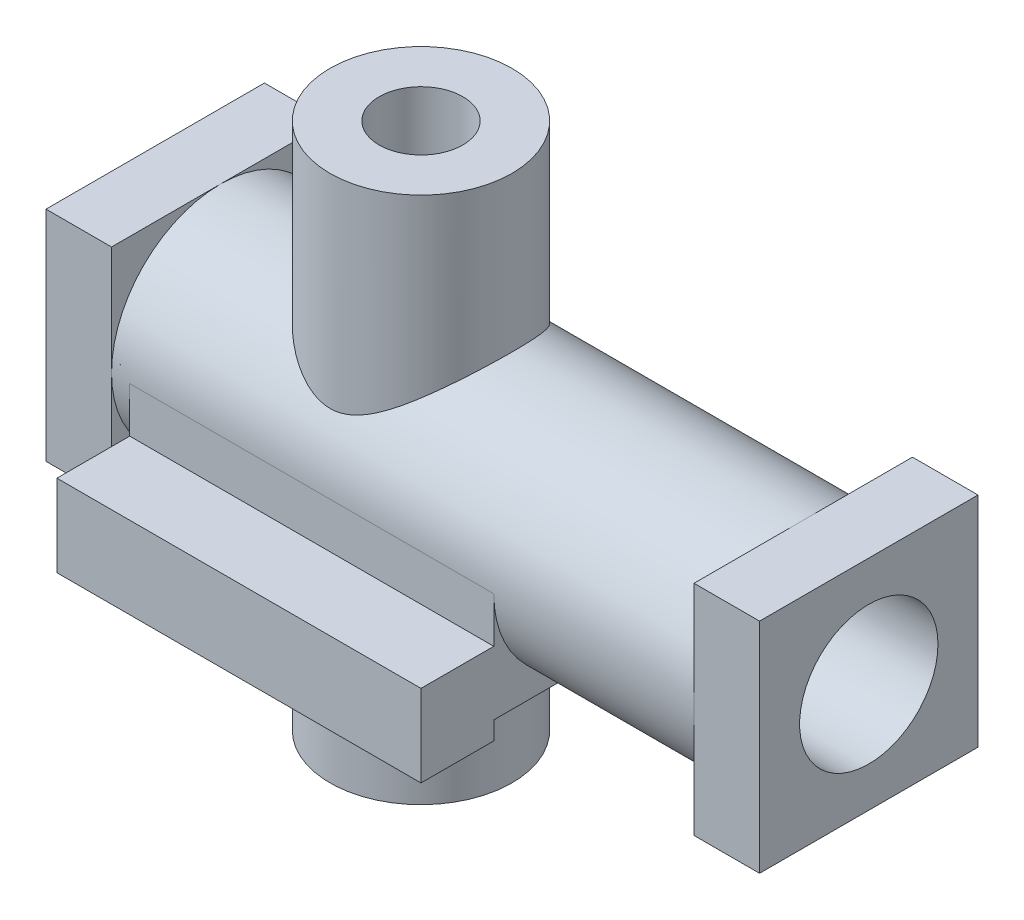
from build123d import *

# Parameters (mm, degrees)
HORIZBODY_DEPTH               = 304.8
HORIZBODY_DEPTH_BACK          = 177.8
SKETCH1_R                     = 76.2
SKETCH2_R                     = 63.5
VERTBODY_DEPTH                = 177.8
SKETCH3_W                     = 152.4
SKETCH3_H                     = 152.4
RIGHTFLANGE_DEPTH             = 38.1
SKETCH4_W                     = 152.4
SKETCH4_H                     = 152.4
LEFTFLANGE_DEPTH              = 38.1
BASEFLANGE_DEPTH              = 127
HORIZBORE_DEPTH               = 376.026505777
HORIZBORE_DEPTH_BACK          = 376.026505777
SKETCH6_R                     = 48.26
VERTBORE_DEPTH                = 376.026505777
VERTBORE_DEPTH_BACK           = 376.026505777
SKETCH7_R                     = 29.21
THICKENTOP_START              = 6.35
SKETCH19_R                    = 63.5
SKETCH19_R_2                  = 29.21
THICKENTOP_DEPTH              = 6.35
SKETCH20_R                    = 63.5
SKETCH20_R_2                  = 29.21
THICKENBOTTOM_DEPTH           = 6.35
SKETCH22_W                    = 152.4
SKETCH22_H                    = 152.4
SKETCH22_R                    = 48.26
THICKENRIGHT_DEPTH            = 7.62
THICKENLEFT_START             = 7.62
SKETCH23_W                    = 152.4
SKETCH23_H                    = 152.4
SKETCH23_R                    = 48.26
THICKENLEFT_DEPTH             = 7.62
SKETCH25_W                    = 254
SKETCH25_H                    = 61.990016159
THICKENBASETOP_DEPTH          = 8.001
SKETCH26_W                    = 254
SKETCH26_H                    = 50.8
THICKENBASEBOTTOM_DEPTH       = 6.35
REMOVEBACKUNDERCUT_REACH      = 402.435
REMOVEBACKUNDERCUT_END_RADIUS = 76.2
SKETCH27_W                    = 254
SKETCH27_H                    = 6.929678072


with BuildPart() as part:
    # Sketch1 → HorizBody (new, two sides: drawn at the far end of the back side and taken through both)
    with BuildSketch(Plane(origin=(0, 0, 0), x_dir=(0, 0, -1), z_dir=(1, 0, 0)).offset(-HORIZBODY_DEPTH_BACK)):
        with Locations(Location((0, 0, 0), (0, 0, 180))):
            Circle(SKETCH1_R)
    extrude(amount=HORIZBODY_DEPTH + HORIZBODY_DEPTH_BACK)

    # Sketch2 → VertBody (add, symmetric)
    with BuildSketch(Plane(origin=(0, 0, 0), x_dir=(1, 0, 0), z_dir=(0, 1, 0))):
        with Locations(Location((0, 0, 0), (0, 0, 90))):
            Circle(SKETCH2_R)
    extrude(amount=VERTBODY_DEPTH, both=True)

    # Sketch3 → RightFlange (add)
    with BuildSketch(Plane(origin=(304.8, 0, 0), x_dir=(0, 0, -1), z_dir=(1, 0, 0))):
        Rectangle(SKETCH3_W, SKETCH3_H)
    extrude(amount=-RIGHTFLANGE_DEPTH)

    # Sketch4 → LeftFlange (add)
    with BuildSketch(Plane.ZY.offset(177.8)):
        Rectangle(SKETCH4_W, SKETCH4_H)
    extrude(amount=-LEFTFLANGE_DEPTH)

    # Sketch5 → BaseFlange (add, symmetric)
    with BuildSketch(Plane(origin=(0, 0, 0), x_dir=(0, 0, -1), z_dir=(1, 0, 0))):
        Polygon((-76.2, -76.2), (76.2, -76.2), (76.2, -82.55), (127, -82.55), (127, -39.751), (-127, -39.751), (-127, -82.55), (-76.2, -82.55), align=None)
    extrude(amount=BASEFLANGE_DEPTH, both=True)

    # Sketch6 → HorizBore (cut, two sides: drawn at the far end of the back side and taken through both)
    with BuildSketch(Plane(origin=(0, 0, 0), x_dir=(0, 0, -1), z_dir=(1, 0, 0)).offset(-HORIZBORE_DEPTH_BACK)):
        Circle(SKETCH6_R)
    extrude(amount=HORIZBORE_DEPTH + HORIZBORE_DEPTH_BACK, mode=Mode.SUBTRACT)

    # Sketch7 → VertBore (cut, two sides: drawn at the far end of the back side and taken through both)
    with BuildSketch(Plane(origin=(0, 0, 0), x_dir=(1, 0, 0), z_dir=(0, 1, 0)).offset(-VERTBORE_DEPTH_BACK)):
        with Locations(Location((0, 0, 0), (0, 0, 270))):
            Circle(SKETCH7_R)
    extrude(amount=VERTBORE_DEPTH + VERTBORE_DEPTH_BACK, mode=Mode.SUBTRACT)

    # Sketch19 → ThickenTop (add)
    with BuildSketch(Plane(origin=(0, 177.8, 0), x_dir=(-1, 0, 0), z_dir=(0, 1, 0)).offset(THICKENTOP_START)):
        with Locations(Location((0, 0, 0), (0, 0, 270))):
            Circle(SKETCH19_R)
        with Locations(Location((0, 0, 0), (0, 0, 90))):
            Circle(SKETCH19_R_2, mode=Mode.SUBTRACT)
    extrude(amount=-THICKENTOP_DEPTH)

    # Sketch20 → ThickenBottom (add)
    with BuildSketch(Plane.XZ.offset(177.8)):
        with Locations(Location((0, 0, 0), (0, 0, 270))):
            Circle(SKETCH20_R)
        with Locations(Location((0, 0, 0), (0, 0, 90))):
            Circle(SKETCH20_R_2, mode=Mode.SUBTRACT)
    extrude(amount=THICKENBOTTOM_DEPTH)

    # Sketch22 → ThickenRight (add)
    with BuildSketch(Plane(origin=(304.8, 0, 0), x_dir=(0, 0, -1), z_dir=(1, 0, 0))):
        Rectangle(SKETCH22_W, SKETCH22_H)
        Circle(SKETCH22_R, mode=Mode.SUBTRACT)
    extrude(amount=THICKENRIGHT_DEPTH)

    # Sketch23 → ThickenLeft (add)
    with BuildSketch(Plane.ZY.offset(177.8).offset(THICKENLEFT_START)):
        Rectangle(SKETCH23_W, SKETCH23_H)
        with Locations(Location((0, 0, 0), (0, 0, 180))):
            Circle(SKETCH23_R, mode=Mode.SUBTRACT)
    extrude(amount=-THICKENLEFT_DEPTH)

    # Sketch25 → ThickenBaseTop (add)
    with BuildSketch(Plane(origin=(0, -39.751, 0), x_dir=(-1, 0, 0), z_dir=(0, 1, 0))):
        with Locations((0, 96.004991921)):
            Rectangle(SKETCH25_W, SKETCH25_H)
        with Locations((0, -96.004991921)):
            Rectangle(SKETCH25_W, SKETCH25_H)
    extrude(amount=THICKENBASETOP_DEPTH)

    # Sketch26 → ThickenBaseBottom (add)
    with BuildSketch(Plane.XZ.offset(82.55)):
        with Locations((0, 101.6)):
            Rectangle(SKETCH26_W, SKETCH26_H)
        with Locations((0, -101.6)):
            Rectangle(SKETCH26_W, SKETCH26_H)
    extrude(amount=THICKENBASEBOTTOM_DEPTH)

    # RemoveBackUndercut: up to this cylinder (the profile starts outside it)
    removebackundercut_end = Plane(origin=(0, 0, 0), z_dir=(-1, 0, 0)) * Cylinder(REMOVEBACKUNDERCUT_END_RADIUS, 958.27, mode=Mode.PRIVATE)
    # Sketch27 → RemoveBackUndercut (add, up to the surface)
    with BuildSketch(Plane(origin=(0, -31.75, 0), x_dir=(-1, 0, 0), z_dir=(0, 1, 0)), mode=Mode.PRIVATE) as removebackundercut_sk1:
        with Locations((0, -72.735160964)):
            Rectangle(SKETCH27_W, SKETCH27_H)
    removebackundercut_tool1 = extrude(removebackundercut_sk1.sketch, amount=REMOVEBACKUNDERCUT_REACH, mode=Mode.PRIVATE) - removebackundercut_end
    removebackundercut = removebackundercut_tool1.solids().sort_by_distance((0, -31.75, -72.735161))[0]
    add(removebackundercut)

    # RemoveFrontUndercut: RemoveBackUndercut across plane
    add(removebackundercut.mirror(Plane.XY))


solid = part.part
